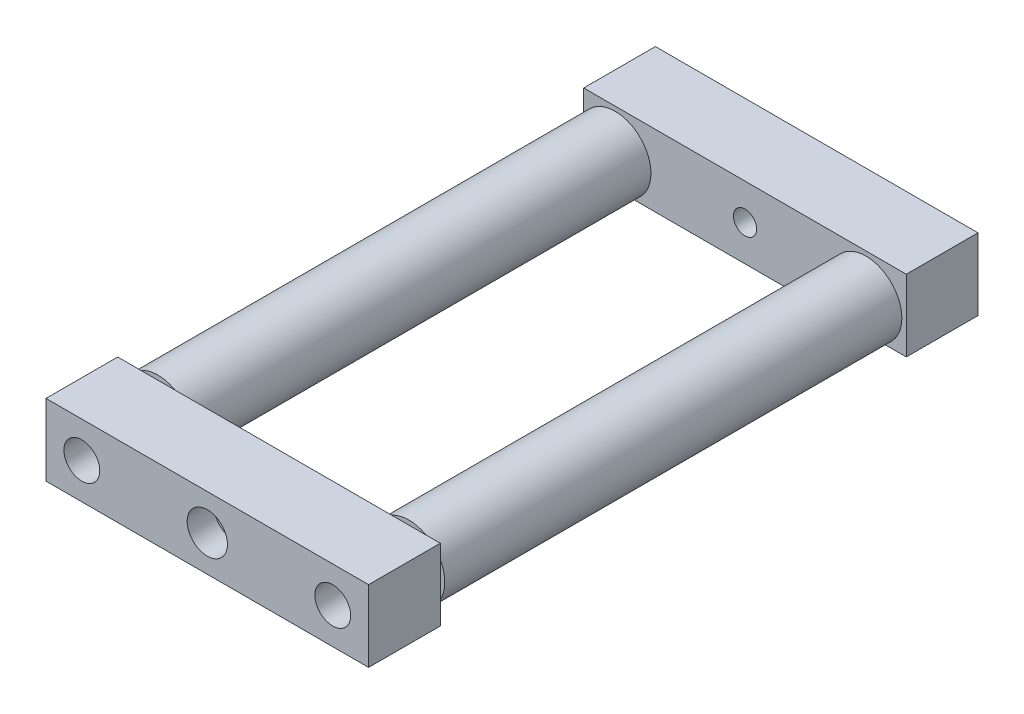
ISO-10303-21;
HEADER;
FILE_DESCRIPTION(('STEP AP214'),'2;1');
FILE_NAME('part.step','',(''),(''),'','','');
FILE_SCHEMA(('AUTOMOTIVE_DESIGN { 1 0 10303 214 1 1 1 1 }'));
ENDSEC;
DATA;
#1=APPLICATION_CONTEXT('core data for automotive mechanical design processes');
#2=APPLICATION_PROTOCOL_DEFINITION('international standard','automotive_design',2000,#1);
#3=PRODUCT_CONTEXT('',#1,'mechanical');
#4=PRODUCT('Part','Part','',(#3));
#5=PRODUCT_RELATED_PRODUCT_CATEGORY('part','',(#4));
#6=PRODUCT_DEFINITION_FORMATION('','',#4);
#7=PRODUCT_DEFINITION_CONTEXT('part definition',#1,'design');
#8=PRODUCT_DEFINITION('design','',#6,#7);
#9=PRODUCT_DEFINITION_SHAPE('','',#8);
#10=(LENGTH_UNIT() NAMED_UNIT(*) SI_UNIT(.MILLI.,.METRE.));
#11=(NAMED_UNIT(*) PLANE_ANGLE_UNIT() SI_UNIT($,.RADIAN.));
#12=(NAMED_UNIT(*) SI_UNIT($,.STERADIAN.) SOLID_ANGLE_UNIT());
#13=UNCERTAINTY_MEASURE_WITH_UNIT(LENGTH_MEASURE(1.E-05),#10,'distance_accuracy_value','');
#14=(GEOMETRIC_REPRESENTATION_CONTEXT(3) GLOBAL_UNCERTAINTY_ASSIGNED_CONTEXT((#13)) GLOBAL_UNIT_ASSIGNED_CONTEXT((#10,
#11,#12)) REPRESENTATION_CONTEXT('',''));
#15=CARTESIAN_POINT('',(0.,0.,0.));
#16=DIRECTION('',(0.,0.,1.));
#17=DIRECTION('',(1.,0.,0.));
#18=AXIS2_PLACEMENT_3D('',#15,#16,#17);
#19=CARTESIAN_POINT('',(22.225,0.,40.4876));
#20=DIRECTION('',(0.,0.,1.));
#21=DIRECTION('',(1.,0.,0.));
#22=AXIS2_PLACEMENT_3D('',#19,#20,#21);
#23=PLANE('',#22);
#24=CARTESIAN_POINT('',(22.225,0.,40.4876));
#25=DIRECTION('',(0.,0.,1.));
#26=DIRECTION('',(1.,0.,0.));
#27=AXIS2_PLACEMENT_3D('',#24,#25,#26);
#28=CIRCLE('',#27,6.35);
#29=CARTESIAN_POINT('',(28.575,0.,40.4876));
#30=VERTEX_POINT('',#29);
#31=EDGE_CURVE('E11',#30,#30,#28,.T.);
#32=ORIENTED_EDGE('',*,*,#31,.T.);
#33=EDGE_LOOP('',(#32));
#34=FACE_BOUND('',#33,.T.);
#35=CARTESIAN_POINT('',(22.225,0.,40.4876));
#36=DIRECTION('',(0.,0.,1.));
#37=DIRECTION('',(1.,0.,0.));
#38=AXIS2_PLACEMENT_3D('',#35,#36,#37);
#39=CIRCLE('',#38,3.175);
#40=CARTESIAN_POINT('',(25.4,0.,40.4876));
#41=VERTEX_POINT('',#40);
#42=EDGE_CURVE('E53',#41,#41,#39,.T.);
#43=ORIENTED_EDGE('',*,*,#42,.F.);
#44=EDGE_LOOP('',(#43));
#45=FACE_BOUND('',#44,.T.);
#46=ADVANCED_FACE('F42',(#34,#45),#23,.T.);
#47=CARTESIAN_POINT('',(22.225,0.,-40.4876));
#48=DIRECTION('',(0.,0.,1.));
#49=DIRECTION('',(1.,0.,0.));
#50=AXIS2_PLACEMENT_3D('',#47,#48,#49);
#51=PLANE('',#50);
#52=CARTESIAN_POINT('',(22.225,0.,-40.4876));
#53=DIRECTION('',(0.,0.,1.));
#54=DIRECTION('',(1.,0.,0.));
#55=AXIS2_PLACEMENT_3D('',#52,#53,#54);
#56=CIRCLE('',#55,6.35);
#57=CARTESIAN_POINT('',(28.575,0.,-40.4876));
#58=VERTEX_POINT('',#57);
#59=EDGE_CURVE('E46',#58,#58,#56,.T.);
#60=ORIENTED_EDGE('',*,*,#59,.F.);
#61=EDGE_LOOP('',(#60));
#62=FACE_BOUND('',#61,.T.);
#63=CARTESIAN_POINT('',(22.225,0.,-40.4876));
#64=DIRECTION('',(0.,0.,1.));
#65=DIRECTION('',(1.,0.,0.));
#66=AXIS2_PLACEMENT_3D('',#63,#64,#65);
#67=CIRCLE('',#66,3.175);
#68=CARTESIAN_POINT('',(25.4,0.,-40.4876));
#69=VERTEX_POINT('',#68);
#70=EDGE_CURVE('E55',#69,#69,#67,.T.);
#71=ORIENTED_EDGE('',*,*,#70,.T.);
#72=EDGE_LOOP('',(#71));
#73=FACE_BOUND('',#72,.T.);
#74=ADVANCED_FACE('F65',(#62,#73),#51,.F.);
#75=CARTESIAN_POINT('',(22.225,0.,40.4876));
#76=DIRECTION('',(0.,0.,-1.));
#77=DIRECTION('',(-1.,0.,0.));
#78=AXIS2_PLACEMENT_3D('',#75,#76,#77);
#79=CYLINDRICAL_SURFACE('',#78,6.35);
#80=ORIENTED_EDGE('',*,*,#31,.F.);
#81=EDGE_LOOP('',(#80));
#82=FACE_BOUND('',#81,.T.);
#83=ORIENTED_EDGE('',*,*,#59,.T.);
#84=EDGE_LOOP('',(#83));
#85=FACE_BOUND('',#84,.T.);
#86=ADVANCED_FACE('F44',(#82,#85),#79,.T.);
#87=CARTESIAN_POINT('',(22.225,0.,40.4876));
#88=DIRECTION('',(0.,0.,-1.));
#89=DIRECTION('',(-1.,0.,0.));
#90=AXIS2_PLACEMENT_3D('',#87,#88,#89);
#91=CYLINDRICAL_SURFACE('',#90,3.175);
#92=ORIENTED_EDGE('',*,*,#42,.T.);
#93=EDGE_LOOP('',(#92));
#94=FACE_BOUND('',#93,.T.);
#95=ORIENTED_EDGE('',*,*,#70,.F.);
#96=EDGE_LOOP('',(#95));
#97=FACE_BOUND('',#96,.T.);
#98=ADVANCED_FACE('F61',(#94,#97),#91,.F.);
#99=CLOSED_SHELL('',(#46,#74,#86,#98));
#100=MANIFOLD_SOLID_BREP('B2',#99);
#101=CARTESIAN_POINT('',(-22.225,0.,40.4876));
#102=DIRECTION('',(0.,0.,1.));
#103=DIRECTION('',(1.,0.,0.));
#104=AXIS2_PLACEMENT_3D('',#101,#102,#103);
#105=PLANE('',#104);
#106=CARTESIAN_POINT('',(-22.225,0.,40.4876));
#107=DIRECTION('',(0.,0.,1.));
#108=DIRECTION('',(1.,0.,0.));
#109=AXIS2_PLACEMENT_3D('',#106,#107,#108);
#110=CIRCLE('',#109,6.35);
#111=CARTESIAN_POINT('',(-15.875,0.,40.4876));
#112=VERTEX_POINT('',#111);
#113=EDGE_CURVE('E41',#112,#112,#110,.T.);
#114=ORIENTED_EDGE('',*,*,#113,.T.);
#115=EDGE_LOOP('',(#114));
#116=FACE_BOUND('',#115,.T.);
#117=CARTESIAN_POINT('',(-22.225,0.,40.4876));
#118=DIRECTION('',(0.,0.,1.));
#119=DIRECTION('',(1.,0.,0.));
#120=AXIS2_PLACEMENT_3D('',#117,#118,#119);
#121=CIRCLE('',#120,3.175);
#122=CARTESIAN_POINT('',(-19.05,0.,40.4876));
#123=VERTEX_POINT('',#122);
#124=EDGE_CURVE('E125',#123,#123,#121,.T.);
#125=ORIENTED_EDGE('',*,*,#124,.F.);
#126=EDGE_LOOP('',(#125));
#127=FACE_BOUND('',#126,.T.);
#128=ADVANCED_FACE('F114',(#116,#127),#105,.T.);
#129=CARTESIAN_POINT('',(-22.225,0.,-40.4876));
#130=DIRECTION('',(0.,0.,1.));
#131=DIRECTION('',(1.,0.,0.));
#132=AXIS2_PLACEMENT_3D('',#129,#130,#131);
#133=PLANE('',#132);
#134=CARTESIAN_POINT('',(-22.225,0.,-40.4876));
#135=DIRECTION('',(0.,0.,1.));
#136=DIRECTION('',(1.,0.,0.));
#137=AXIS2_PLACEMENT_3D('',#134,#135,#136);
#138=CIRCLE('',#137,6.35);
#139=CARTESIAN_POINT('',(-15.875,0.,-40.4876));
#140=VERTEX_POINT('',#139);
#141=EDGE_CURVE('E118',#140,#140,#138,.T.);
#142=ORIENTED_EDGE('',*,*,#141,.F.);
#143=EDGE_LOOP('',(#142));
#144=FACE_BOUND('',#143,.T.);
#145=CARTESIAN_POINT('',(-22.225,0.,-40.4876));
#146=DIRECTION('',(0.,0.,1.));
#147=DIRECTION('',(1.,0.,0.));
#148=AXIS2_PLACEMENT_3D('',#145,#146,#147);
#149=CIRCLE('',#148,3.175);
#150=CARTESIAN_POINT('',(-19.05,0.,-40.4876));
#151=VERTEX_POINT('',#150);
#152=EDGE_CURVE('E127',#151,#151,#149,.T.);
#153=ORIENTED_EDGE('',*,*,#152,.T.);
#154=EDGE_LOOP('',(#153));
#155=FACE_BOUND('',#154,.T.);
#156=ADVANCED_FACE('F137',(#144,#155),#133,.F.);
#157=CARTESIAN_POINT('',(-22.225,0.,40.4876));
#158=DIRECTION('',(0.,0.,-1.));
#159=DIRECTION('',(-1.,0.,0.));
#160=AXIS2_PLACEMENT_3D('',#157,#158,#159);
#161=CYLINDRICAL_SURFACE('',#160,6.35);
#162=ORIENTED_EDGE('',*,*,#113,.F.);
#163=EDGE_LOOP('',(#162));
#164=FACE_BOUND('',#163,.T.);
#165=ORIENTED_EDGE('',*,*,#141,.T.);
#166=EDGE_LOOP('',(#165));
#167=FACE_BOUND('',#166,.T.);
#168=ADVANCED_FACE('F116',(#164,#167),#161,.T.);
#169=CARTESIAN_POINT('',(-22.225,0.,40.4876));
#170=DIRECTION('',(0.,0.,-1.));
#171=DIRECTION('',(-1.,0.,0.));
#172=AXIS2_PLACEMENT_3D('',#169,#170,#171);
#173=CYLINDRICAL_SURFACE('',#172,3.175);
#174=ORIENTED_EDGE('',*,*,#124,.T.);
#175=EDGE_LOOP('',(#174));
#176=FACE_BOUND('',#175,.T.);
#177=ORIENTED_EDGE('',*,*,#152,.F.);
#178=EDGE_LOOP('',(#177));
#179=FACE_BOUND('',#178,.T.);
#180=ADVANCED_FACE('F133',(#176,#179),#173,.F.);
#181=CLOSED_SHELL('',(#128,#156,#168,#180));
#182=MANIFOLD_SOLID_BREP('B6',#181);
#183=CARTESIAN_POINT('',(-28.575,6.35,-53.975));
#184=DIRECTION('',(-1.,0.,0.));
#185=DIRECTION('',(0.,0.,1.));
#186=AXIS2_PLACEMENT_3D('',#183,#184,#185);
#187=PLANE('',#186);
#188=DIRECTION('',(0.,-1.,0.));
#189=VECTOR('',#188,1.);
#190=CARTESIAN_POINT('',(-28.575,6.35,-41.275));
#191=LINE('',#190,#189);
#192=CARTESIAN_POINT('',(-28.575,6.35,-41.275));
#193=VERTEX_POINT('',#192);
#194=CARTESIAN_POINT('',(-28.575,-6.35,-41.275));
#195=VERTEX_POINT('',#194);
#196=EDGE_CURVE('E252',#193,#195,#191,.T.);
#197=ORIENTED_EDGE('',*,*,#196,.F.);
#198=DIRECTION('',(0.,0.,1.));
#199=VECTOR('',#198,1.);
#200=CARTESIAN_POINT('',(-28.575,6.35,-53.975));
#201=LINE('',#200,#199);
#202=CARTESIAN_POINT('',(-28.575,6.35,-53.975));
#203=VERTEX_POINT('',#202);
#204=EDGE_CURVE('E112',#203,#193,#201,.T.);
#205=ORIENTED_EDGE('',*,*,#204,.F.);
#206=DIRECTION('',(0.,-1.,0.));
#207=VECTOR('',#206,1.);
#208=CARTESIAN_POINT('',(-28.575,6.35,-53.975));
#209=LINE('',#208,#207);
#210=CARTESIAN_POINT('',(-28.575,-6.35,-53.975));
#211=VERTEX_POINT('',#210);
#212=EDGE_CURVE('E245',#203,#211,#209,.T.);
#213=ORIENTED_EDGE('',*,*,#212,.T.);
#214=DIRECTION('',(0.,0.,1.));
#215=VECTOR('',#214,1.);
#216=CARTESIAN_POINT('',(-28.575,-6.35,-53.975));
#217=LINE('',#216,#215);
#218=EDGE_CURVE('E228',#211,#195,#217,.T.);
#219=ORIENTED_EDGE('',*,*,#218,.T.);
#220=EDGE_LOOP('',(#197,#205,#213,#219));
#221=FACE_BOUND('',#220,.T.);
#222=ADVANCED_FACE('F185',(#221),#187,.T.);
#223=CARTESIAN_POINT('',(28.575,6.35000000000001,-53.975));
#224=DIRECTION('',(0.,1.,0.));
#225=DIRECTION('',(-1.,0.,0.));
#226=AXIS2_PLACEMENT_3D('',#223,#224,#225);
#227=PLANE('',#226);
#228=DIRECTION('',(-1.,0.,0.));
#229=VECTOR('',#228,1.);
#230=CARTESIAN_POINT('',(28.575,6.35000000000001,-41.275));
#231=LINE('',#230,#229);
#232=CARTESIAN_POINT('',(28.575,6.35000000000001,-41.275));
#233=VERTEX_POINT('',#232);
#234=EDGE_CURVE('E247',#233,#193,#231,.T.);
#235=ORIENTED_EDGE('',*,*,#234,.F.);
#236=DIRECTION('',(0.,0.,1.));
#237=VECTOR('',#236,1.);
#238=CARTESIAN_POINT('',(28.575,6.35000000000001,-53.975));
#239=LINE('',#238,#237);
#240=CARTESIAN_POINT('',(28.575,6.35000000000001,-53.975));
#241=VERTEX_POINT('',#240);
#242=EDGE_CURVE('E194',#241,#233,#239,.T.);
#243=ORIENTED_EDGE('',*,*,#242,.F.);
#244=DIRECTION('',(-1.,0.,0.));
#245=VECTOR('',#244,1.);
#246=CARTESIAN_POINT('',(28.575,6.35000000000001,-53.975));
#247=LINE('',#246,#245);
#248=EDGE_CURVE('E242',#241,#203,#247,.T.);
#249=ORIENTED_EDGE('',*,*,#248,.T.);
#250=ORIENTED_EDGE('',*,*,#204,.T.);
#251=EDGE_LOOP('',(#235,#243,#249,#250));
#252=FACE_BOUND('',#251,.T.);
#253=ADVANCED_FACE('F294',(#252),#227,.T.);
#254=CARTESIAN_POINT('',(28.575,-6.35,-53.975));
#255=DIRECTION('',(1.,0.,0.));
#256=DIRECTION('',(0.,0.,-1.));
#257=AXIS2_PLACEMENT_3D('',#254,#255,#256);
#258=PLANE('',#257);
#259=DIRECTION('',(0.,1.,0.));
#260=VECTOR('',#259,1.);
#261=CARTESIAN_POINT('',(28.575,-6.35,-41.275));
#262=LINE('',#261,#260);
#263=CARTESIAN_POINT('',(28.575,-6.35,-41.275));
#264=VERTEX_POINT('',#263);
#265=EDGE_CURVE('E236',#264,#233,#262,.T.);
#266=ORIENTED_EDGE('',*,*,#265,.F.);
#267=DIRECTION('',(0.,0.,1.));
#268=VECTOR('',#267,1.);
#269=CARTESIAN_POINT('',(28.575,-6.35,-53.975));
#270=LINE('',#269,#268);
#271=CARTESIAN_POINT('',(28.575,-6.35,-53.975));
#272=VERTEX_POINT('',#271);
#273=EDGE_CURVE('E231',#272,#264,#270,.T.);
#274=ORIENTED_EDGE('',*,*,#273,.F.);
#275=DIRECTION('',(0.,1.,0.));
#276=VECTOR('',#275,1.);
#277=CARTESIAN_POINT('',(28.575,-6.35,-53.975));
#278=LINE('',#277,#276);
#279=EDGE_CURVE('E234',#272,#241,#278,.T.);
#280=ORIENTED_EDGE('',*,*,#279,.T.);
#281=ORIENTED_EDGE('',*,*,#242,.T.);
#282=EDGE_LOOP('',(#266,#274,#280,#281));
#283=FACE_BOUND('',#282,.T.);
#284=ADVANCED_FACE('F233',(#283),#258,.T.);
#285=CARTESIAN_POINT('',(-28.575,-6.35,-53.975));
#286=DIRECTION('',(0.,-1.,0.));
#287=DIRECTION('',(0.,0.,-1.));
#288=AXIS2_PLACEMENT_3D('',#285,#286,#287);
#289=PLANE('',#288);
#290=DIRECTION('',(1.,0.,0.));
#291=VECTOR('',#290,1.);
#292=CARTESIAN_POINT('',(-28.575,-6.35,-41.275));
#293=LINE('',#292,#291);
#294=EDGE_CURVE('E255',#195,#264,#293,.T.);
#295=ORIENTED_EDGE('',*,*,#294,.F.);
#296=ORIENTED_EDGE('',*,*,#218,.F.);
#297=DIRECTION('',(1.,0.,0.));
#298=VECTOR('',#297,1.);
#299=CARTESIAN_POINT('',(-28.575,-6.35,-53.975));
#300=LINE('',#299,#298);
#301=EDGE_CURVE('E241',#211,#272,#300,.T.);
#302=ORIENTED_EDGE('',*,*,#301,.T.);
#303=ORIENTED_EDGE('',*,*,#273,.T.);
#304=EDGE_LOOP('',(#295,#296,#302,#303));
#305=FACE_BOUND('',#304,.T.);
#306=ADVANCED_FACE('F244',(#305),#289,.T.);
#307=CARTESIAN_POINT('',(0.,0.,-53.975));
#308=DIRECTION('',(0.,0.,1.));
#309=DIRECTION('',(1.,0.,0.));
#310=AXIS2_PLACEMENT_3D('',#307,#308,#309);
#311=PLANE('',#310);
#312=CARTESIAN_POINT('',(0.,0.,-53.975));
#313=DIRECTION('',(0.,0.,1.));
#314=DIRECTION('',(1.,0.,0.));
#315=AXIS2_PLACEMENT_3D('',#312,#313,#314);
#316=CIRCLE('',#315,3.5687);
#317=CARTESIAN_POINT('',(3.5687,0.,-53.975));
#318=VERTEX_POINT('',#317);
#319=EDGE_CURVE('E188',#318,#318,#316,.T.);
#320=ORIENTED_EDGE('',*,*,#319,.T.);
#321=EDGE_LOOP('',(#320));
#322=FACE_BOUND('',#321,.T.);
#323=CARTESIAN_POINT('',(22.225,0.,-53.975));
#324=DIRECTION('',(0.,0.,1.));
#325=DIRECTION('',(1.,0.,0.));
#326=AXIS2_PLACEMENT_3D('',#323,#324,#325);
#327=CIRCLE('',#326,3.175);
#328=CARTESIAN_POINT('',(25.4,0.,-53.975));
#329=VERTEX_POINT('',#328);
#330=EDGE_CURVE('E277',#329,#329,#327,.T.);
#331=ORIENTED_EDGE('',*,*,#330,.T.);
#332=EDGE_LOOP('',(#331));
#333=FACE_BOUND('',#332,.T.);
#334=CARTESIAN_POINT('',(-22.225,0.,-53.975));
#335=DIRECTION('',(0.,0.,1.));
#336=DIRECTION('',(1.,0.,0.));
#337=AXIS2_PLACEMENT_3D('',#334,#335,#336);
#338=CIRCLE('',#337,3.175);
#339=CARTESIAN_POINT('',(-19.05,0.,-53.975));
#340=VERTEX_POINT('',#339);
#341=EDGE_CURVE('E256',#340,#340,#338,.T.);
#342=ORIENTED_EDGE('',*,*,#341,.T.);
#343=EDGE_LOOP('',(#342));
#344=FACE_BOUND('',#343,.T.);
#345=ORIENTED_EDGE('',*,*,#212,.F.);
#346=ORIENTED_EDGE('',*,*,#248,.F.);
#347=ORIENTED_EDGE('',*,*,#279,.F.);
#348=ORIENTED_EDGE('',*,*,#301,.F.);
#349=EDGE_LOOP('',(#345,#346,#347,#348));
#350=FACE_BOUND('',#349,.T.);
#351=ADVANCED_FACE('F240',(#322,#333,#344,#350),#311,.F.);
#352=CARTESIAN_POINT('',(0.,0.,-41.275));
#353=DIRECTION('',(0.,0.,1.));
#354=DIRECTION('',(1.,0.,0.));
#355=AXIS2_PLACEMENT_3D('',#352,#353,#354);
#356=PLANE('',#355);
#357=CARTESIAN_POINT('',(0.,0.,-41.275));
#358=DIRECTION('',(0.,0.,1.));
#359=DIRECTION('',(1.,0.,0.));
#360=AXIS2_PLACEMENT_3D('',#357,#358,#359);
#361=CIRCLE('',#360,2.0574);
#362=CARTESIAN_POINT('',(2.0574,0.,-41.275));
#363=VERTEX_POINT('',#362);
#364=EDGE_CURVE('E263',#363,#363,#361,.T.);
#365=ORIENTED_EDGE('',*,*,#364,.F.);
#366=EDGE_LOOP('',(#365));
#367=FACE_BOUND('',#366,.T.);
#368=CARTESIAN_POINT('',(22.225,0.,-41.275));
#369=DIRECTION('',(0.,0.,1.));
#370=DIRECTION('',(1.,0.,0.));
#371=AXIS2_PLACEMENT_3D('',#368,#369,#370);
#372=CIRCLE('',#371,3.175);
#373=CARTESIAN_POINT('',(25.4,0.,-41.275));
#374=VERTEX_POINT('',#373);
#375=EDGE_CURVE('E265',#374,#374,#372,.T.);
#376=ORIENTED_EDGE('',*,*,#375,.F.);
#377=EDGE_LOOP('',(#376));
#378=FACE_BOUND('',#377,.T.);
#379=CARTESIAN_POINT('',(-22.225,0.,-41.275));
#380=DIRECTION('',(0.,0.,1.));
#381=DIRECTION('',(1.,0.,0.));
#382=AXIS2_PLACEMENT_3D('',#379,#380,#381);
#383=CIRCLE('',#382,3.175);
#384=CARTESIAN_POINT('',(-19.05,0.,-41.275));
#385=VERTEX_POINT('',#384);
#386=EDGE_CURVE('E280',#385,#385,#383,.T.);
#387=ORIENTED_EDGE('',*,*,#386,.F.);
#388=EDGE_LOOP('',(#387));
#389=FACE_BOUND('',#388,.T.);
#390=ORIENTED_EDGE('',*,*,#196,.T.);
#391=ORIENTED_EDGE('',*,*,#294,.T.);
#392=ORIENTED_EDGE('',*,*,#265,.T.);
#393=ORIENTED_EDGE('',*,*,#234,.T.);
#394=EDGE_LOOP('',(#390,#391,#392,#393));
#395=FACE_BOUND('',#394,.T.);
#396=ADVANCED_FACE('F289',(#367,#378,#389,#395),#356,.T.);
#397=CARTESIAN_POINT('',(-22.225,0.,-53.975));
#398=DIRECTION('',(0.,0.,1.));
#399=DIRECTION('',(1.,0.,0.));
#400=AXIS2_PLACEMENT_3D('',#397,#398,#399);
#401=CYLINDRICAL_SURFACE('',#400,3.175);
#402=ORIENTED_EDGE('',*,*,#341,.F.);
#403=EDGE_LOOP('',(#402));
#404=FACE_BOUND('',#403,.T.);
#405=ORIENTED_EDGE('',*,*,#386,.T.);
#406=EDGE_LOOP('',(#405));
#407=FACE_BOUND('',#406,.T.);
#408=ADVANCED_FACE('F287',(#404,#407),#401,.F.);
#409=CARTESIAN_POINT('',(22.225,0.,-53.975));
#410=DIRECTION('',(0.,0.,1.));
#411=DIRECTION('',(1.,0.,0.));
#412=AXIS2_PLACEMENT_3D('',#409,#410,#411);
#413=CYLINDRICAL_SURFACE('',#412,3.175);
#414=ORIENTED_EDGE('',*,*,#330,.F.);
#415=EDGE_LOOP('',(#414));
#416=FACE_BOUND('',#415,.T.);
#417=ORIENTED_EDGE('',*,*,#375,.T.);
#418=EDGE_LOOP('',(#417));
#419=FACE_BOUND('',#418,.T.);
#420=ADVANCED_FACE('F314',(#416,#419),#413,.F.);
#421=CARTESIAN_POINT('',(0.,0.,-50.8));
#422=DIRECTION('',(0.,0.,1.));
#423=DIRECTION('',(1.,0.,0.));
#424=AXIS2_PLACEMENT_3D('',#421,#422,#423);
#425=CYLINDRICAL_SURFACE('',#424,2.0574);
#426=CARTESIAN_POINT('',(0.,0.,-49.2252));
#427=DIRECTION('',(0.,0.,1.));
#428=DIRECTION('',(1.,0.,0.));
#429=AXIS2_PLACEMENT_3D('',#426,#427,#428);
#430=CIRCLE('',#429,2.0574);
#431=CARTESIAN_POINT('',(2.0574,0.,-49.2252));
#432=VERTEX_POINT('',#431);
#433=EDGE_CURVE('E266',#432,#432,#430,.F.);
#434=ORIENTED_EDGE('',*,*,#433,.T.);
#435=EDGE_LOOP('',(#434));
#436=FACE_BOUND('',#435,.T.);
#437=ORIENTED_EDGE('',*,*,#364,.T.);
#438=EDGE_LOOP('',(#437));
#439=FACE_BOUND('',#438,.T.);
#440=ADVANCED_FACE('F318',(#436,#439),#425,.F.);
#441=CARTESIAN_POINT('',(0.,0.,-74.6252));
#442=DIRECTION('',(0.,0.,1.));
#443=DIRECTION('',(1.,0.,0.));
#444=AXIS2_PLACEMENT_3D('',#441,#442,#443);
#445=CYLINDRICAL_SURFACE('',#444,3.5687);
#446=CARTESIAN_POINT('',(0.,0.,-49.2252));
#447=DIRECTION('',(0.,0.,1.));
#448=DIRECTION('',(1.,0.,0.));
#449=AXIS2_PLACEMENT_3D('',#446,#447,#448);
#450=CIRCLE('',#449,3.5687);
#451=CARTESIAN_POINT('',(3.5687,0.,-49.2252));
#452=VERTEX_POINT('',#451);
#453=EDGE_CURVE('E268',#452,#452,#450,.T.);
#454=ORIENTED_EDGE('',*,*,#453,.T.);
#455=EDGE_LOOP('',(#454));
#456=FACE_BOUND('',#455,.T.);
#457=ORIENTED_EDGE('',*,*,#319,.F.);
#458=EDGE_LOOP('',(#457));
#459=FACE_BOUND('',#458,.T.);
#460=ADVANCED_FACE('F322',(#456,#459),#445,.F.);
#461=CARTESIAN_POINT('',(0.,0.,-49.2252));
#462=DIRECTION('',(0.,0.,1.));
#463=DIRECTION('',(1.,0.,0.));
#464=AXIS2_PLACEMENT_3D('',#461,#462,#463);
#465=PLANE('',#464);
#466=ORIENTED_EDGE('',*,*,#453,.F.);
#467=EDGE_LOOP('',(#466));
#468=FACE_BOUND('',#467,.T.);
#469=ORIENTED_EDGE('',*,*,#433,.F.);
#470=EDGE_LOOP('',(#469));
#471=FACE_BOUND('',#470,.T.);
#472=ADVANCED_FACE('F325',(#468,#471),#465,.F.);
#473=CLOSED_SHELL('',(#222,#253,#284,#306,#351,#396,#408,#420,#440,#460,#472));
#474=MANIFOLD_SOLID_BREP('B36',#473);
#475=CARTESIAN_POINT('',(0.,0.,53.975));
#476=DIRECTION('',(0.,0.,1.));
#477=DIRECTION('',(1.,0.,0.));
#478=AXIS2_PLACEMENT_3D('',#475,#476,#477);
#479=PLANE('',#478);
#480=CARTESIAN_POINT('',(22.225,0.,53.975));
#481=DIRECTION('',(0.,0.,1.));
#482=DIRECTION('',(1.,0.,0.));
#483=AXIS2_PLACEMENT_3D('',#480,#481,#482);
#484=CIRCLE('',#483,3.175);
#485=CARTESIAN_POINT('',(25.4,0.,53.975));
#486=VERTEX_POINT('',#485);
#487=EDGE_CURVE('E492',#486,#486,#484,.T.);
#488=ORIENTED_EDGE('',*,*,#487,.F.);
#489=EDGE_LOOP('',(#488));
#490=FACE_BOUND('',#489,.T.);
#491=DIRECTION('',(0.,-1.,0.));
#492=VECTOR('',#491,1.);
#493=CARTESIAN_POINT('',(-28.575,6.35,53.975));
#494=LINE('',#493,#492);
#495=CARTESIAN_POINT('',(-28.575,6.35,53.975));
#496=VERTEX_POINT('',#495);
#497=CARTESIAN_POINT('',(-28.575,-6.35,53.975));
#498=VERTEX_POINT('',#497);
#499=EDGE_CURVE('E456',#496,#498,#494,.T.);
#500=ORIENTED_EDGE('',*,*,#499,.T.);
#501=DIRECTION('',(1.,0.,0.));
#502=VECTOR('',#501,1.);
#503=CARTESIAN_POINT('',(-28.575,-6.35,53.975));
#504=LINE('',#503,#502);
#505=CARTESIAN_POINT('',(28.575,-6.35,53.975));
#506=VERTEX_POINT('',#505);
#507=EDGE_CURVE('E451',#498,#506,#504,.T.);
#508=ORIENTED_EDGE('',*,*,#507,.T.);
#509=DIRECTION('',(0.,1.,0.));
#510=VECTOR('',#509,1.);
#511=CARTESIAN_POINT('',(28.575,-6.35,53.975));
#512=LINE('',#511,#510);
#513=CARTESIAN_POINT('',(28.575,6.35000000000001,53.975));
#514=VERTEX_POINT('',#513);
#515=EDGE_CURVE('E454',#506,#514,#512,.T.);
#516=ORIENTED_EDGE('',*,*,#515,.T.);
#517=DIRECTION('',(-1.,0.,0.));
#518=VECTOR('',#517,1.);
#519=CARTESIAN_POINT('',(28.575,6.35000000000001,53.975));
#520=LINE('',#519,#518);
#521=EDGE_CURVE('E421',#514,#496,#520,.T.);
#522=ORIENTED_EDGE('',*,*,#521,.T.);
#523=EDGE_LOOP('',(#500,#508,#516,#522));
#524=FACE_BOUND('',#523,.T.);
#525=CARTESIAN_POINT('',(-22.225,0.,53.975));
#526=DIRECTION('',(0.,0.,1.));
#527=DIRECTION('',(1.,0.,0.));
#528=AXIS2_PLACEMENT_3D('',#525,#526,#527);
#529=CIRCLE('',#528,3.175);
#530=CARTESIAN_POINT('',(-19.05,0.,53.975));
#531=VERTEX_POINT('',#530);
#532=EDGE_CURVE('E472',#531,#531,#529,.T.);
#533=ORIENTED_EDGE('',*,*,#532,.F.);
#534=EDGE_LOOP('',(#533));
#535=FACE_BOUND('',#534,.T.);
#536=CARTESIAN_POINT('',(0.,0.,53.975));
#537=DIRECTION('',(0.,0.,1.));
#538=DIRECTION('',(1.,0.,0.));
#539=AXIS2_PLACEMENT_3D('',#536,#537,#538);
#540=CIRCLE('',#539,3.5687);
#541=CARTESIAN_POINT('',(3.5687,0.,53.975));
#542=VERTEX_POINT('',#541);
#543=EDGE_CURVE('E406',#542,#542,#540,.F.);
#544=ORIENTED_EDGE('',*,*,#543,.T.);
#545=EDGE_LOOP('',(#544));
#546=FACE_BOUND('',#545,.T.);
#547=ADVANCED_FACE('F402',(#490,#524,#535,#546),#479,.T.);
#548=CARTESIAN_POINT('',(0.,0.,-50.8));
#549=DIRECTION('',(0.,0.,1.));
#550=DIRECTION('',(1.,0.,0.));
#551=AXIS2_PLACEMENT_3D('',#548,#549,#550);
#552=CYLINDRICAL_SURFACE('',#551,2.0574);
#553=CARTESIAN_POINT('',(0.,0.,41.275));
#554=DIRECTION('',(0.,0.,1.));
#555=DIRECTION('',(1.,0.,0.));
#556=AXIS2_PLACEMENT_3D('',#553,#554,#555);
#557=CIRCLE('',#556,2.0574);
#558=CARTESIAN_POINT('',(2.0574,0.,41.275));
#559=VERTEX_POINT('',#558);
#560=EDGE_CURVE('E478',#559,#559,#557,.T.);
#561=ORIENTED_EDGE('',*,*,#560,.F.);
#562=EDGE_LOOP('',(#561));
#563=FACE_BOUND('',#562,.T.);
#564=CARTESIAN_POINT('',(0.,0.,49.2252));
#565=DIRECTION('',(0.,0.,1.));
#566=DIRECTION('',(1.,0.,0.));
#567=AXIS2_PLACEMENT_3D('',#564,#565,#566);
#568=CIRCLE('',#567,2.0574);
#569=CARTESIAN_POINT('',(2.0574,0.,49.2252));
#570=VERTEX_POINT('',#569);
#571=EDGE_CURVE('E481',#570,#570,#568,.F.);
#572=ORIENTED_EDGE('',*,*,#571,.F.);
#573=EDGE_LOOP('',(#572));
#574=FACE_BOUND('',#573,.T.);
#575=ADVANCED_FACE('F522',(#563,#574),#552,.F.);
#576=CARTESIAN_POINT('',(0.,0.,41.275));
#577=DIRECTION('',(0.,0.,1.));
#578=DIRECTION('',(1.,0.,0.));
#579=AXIS2_PLACEMENT_3D('',#576,#577,#578);
#580=PLANE('',#579);
#581=ORIENTED_EDGE('',*,*,#560,.T.);
#582=EDGE_LOOP('',(#581));
#583=FACE_BOUND('',#582,.T.);
#584=CARTESIAN_POINT('',(-22.225,0.,41.275));
#585=DIRECTION('',(0.,0.,1.));
#586=DIRECTION('',(1.,0.,0.));
#587=AXIS2_PLACEMENT_3D('',#584,#585,#586);
#588=CIRCLE('',#587,3.175);
#589=CARTESIAN_POINT('',(-19.05,0.,41.275));
#590=VERTEX_POINT('',#589);
#591=EDGE_CURVE('E495',#590,#590,#588,.T.);
#592=ORIENTED_EDGE('',*,*,#591,.T.);
#593=EDGE_LOOP('',(#592));
#594=FACE_BOUND('',#593,.T.);
#595=DIRECTION('',(0.,-1.,0.));
#596=VECTOR('',#595,1.);
#597=CARTESIAN_POINT('',(-28.575,6.35,41.275));
#598=LINE('',#597,#596);
#599=CARTESIAN_POINT('',(-28.575,6.35,41.275));
#600=VERTEX_POINT('',#599);
#601=CARTESIAN_POINT('',(-28.575,-6.35,41.275));
#602=VERTEX_POINT('',#601);
#603=EDGE_CURVE('E469',#600,#602,#598,.T.);
#604=ORIENTED_EDGE('',*,*,#603,.F.);
#605=DIRECTION('',(-1.,0.,0.));
#606=VECTOR('',#605,1.);
#607=CARTESIAN_POINT('',(28.575,6.35000000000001,41.275));
#608=LINE('',#607,#606);
#609=CARTESIAN_POINT('',(28.575,6.35000000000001,41.275));
#610=VERTEX_POINT('',#609);
#611=EDGE_CURVE('E444',#610,#600,#608,.T.);
#612=ORIENTED_EDGE('',*,*,#611,.F.);
#613=DIRECTION('',(0.,1.,0.));
#614=VECTOR('',#613,1.);
#615=CARTESIAN_POINT('',(28.575,-6.35,41.275));
#616=LINE('',#615,#614);
#617=CARTESIAN_POINT('',(28.575,-6.35,41.275));
#618=VERTEX_POINT('',#617);
#619=EDGE_CURVE('E438',#618,#610,#616,.T.);
#620=ORIENTED_EDGE('',*,*,#619,.F.);
#621=DIRECTION('',(1.,0.,0.));
#622=VECTOR('',#621,1.);
#623=CARTESIAN_POINT('',(-28.575,-6.35,41.275));
#624=LINE('',#623,#622);
#625=EDGE_CURVE('E460',#602,#618,#624,.T.);
#626=ORIENTED_EDGE('',*,*,#625,.F.);
#627=EDGE_LOOP('',(#604,#612,#620,#626));
#628=FACE_BOUND('',#627,.T.);
#629=CARTESIAN_POINT('',(22.225,0.,41.275));
#630=DIRECTION('',(0.,0.,1.));
#631=DIRECTION('',(1.,0.,0.));
#632=AXIS2_PLACEMENT_3D('',#629,#630,#631);
#633=CIRCLE('',#632,3.175);
#634=CARTESIAN_POINT('',(25.4,0.,41.275));
#635=VERTEX_POINT('',#634);
#636=EDGE_CURVE('E480',#635,#635,#633,.T.);
#637=ORIENTED_EDGE('',*,*,#636,.T.);
#638=EDGE_LOOP('',(#637));
#639=FACE_BOUND('',#638,.T.);
#640=ADVANCED_FACE('F503',(#583,#594,#628,#639),#580,.F.);
#641=CARTESIAN_POINT('',(-28.575,6.35,53.975));
#642=DIRECTION('',(1.,0.,0.));
#643=DIRECTION('',(0.,0.,-1.));
#644=AXIS2_PLACEMENT_3D('',#641,#642,#643);
#645=PLANE('',#644);
#646=ORIENTED_EDGE('',*,*,#603,.T.);
#647=DIRECTION('',(0.,0.,-1.));
#648=VECTOR('',#647,1.);
#649=CARTESIAN_POINT('',(-28.575,-6.35,53.975));
#650=LINE('',#649,#648);
#651=EDGE_CURVE('E183',#498,#602,#650,.T.);
#652=ORIENTED_EDGE('',*,*,#651,.F.);
#653=ORIENTED_EDGE('',*,*,#499,.F.);
#654=DIRECTION('',(0.,0.,-1.));
#655=VECTOR('',#654,1.);
#656=CARTESIAN_POINT('',(-28.575,6.35,53.975));
#657=LINE('',#656,#655);
#658=EDGE_CURVE('E465',#496,#600,#657,.T.);
#659=ORIENTED_EDGE('',*,*,#658,.T.);
#660=EDGE_LOOP('',(#646,#652,#653,#659));
#661=FACE_BOUND('',#660,.T.);
#662=ADVANCED_FACE('F404',(#661),#645,.F.);
#663=CARTESIAN_POINT('',(-28.575,-6.35,53.975));
#664=DIRECTION('',(0.,1.,0.));
#665=DIRECTION('',(0.,0.,1.));
#666=AXIS2_PLACEMENT_3D('',#663,#664,#665);
#667=PLANE('',#666);
#668=ORIENTED_EDGE('',*,*,#625,.T.);
#669=DIRECTION('',(0.,0.,-1.));
#670=VECTOR('',#669,1.);
#671=CARTESIAN_POINT('',(28.575,-6.35,53.975));
#672=LINE('',#671,#670);
#673=EDGE_CURVE('E412',#506,#618,#672,.T.);
#674=ORIENTED_EDGE('',*,*,#673,.F.);
#675=ORIENTED_EDGE('',*,*,#507,.F.);
#676=ORIENTED_EDGE('',*,*,#651,.T.);
#677=EDGE_LOOP('',(#668,#674,#675,#676));
#678=FACE_BOUND('',#677,.T.);
#679=ADVANCED_FACE('F459',(#678),#667,.F.);
#680=CARTESIAN_POINT('',(28.575,-6.35,53.975));
#681=DIRECTION('',(-1.,0.,0.));
#682=DIRECTION('',(0.,0.,1.));
#683=AXIS2_PLACEMENT_3D('',#680,#681,#682);
#684=PLANE('',#683);
#685=ORIENTED_EDGE('',*,*,#619,.T.);
#686=DIRECTION('',(0.,0.,-1.));
#687=VECTOR('',#686,1.);
#688=CARTESIAN_POINT('',(28.575,6.35000000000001,53.975));
#689=LINE('',#688,#687);
#690=EDGE_CURVE('E461',#514,#610,#689,.T.);
#691=ORIENTED_EDGE('',*,*,#690,.F.);
#692=ORIENTED_EDGE('',*,*,#515,.F.);
#693=ORIENTED_EDGE('',*,*,#673,.T.);
#694=EDGE_LOOP('',(#685,#691,#692,#693));
#695=FACE_BOUND('',#694,.T.);
#696=ADVANCED_FACE('F463',(#695),#684,.F.);
#697=CARTESIAN_POINT('',(28.575,6.35000000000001,53.975));
#698=DIRECTION('',(0.,-1.,0.));
#699=DIRECTION('',(1.,0.,0.));
#700=AXIS2_PLACEMENT_3D('',#697,#698,#699);
#701=PLANE('',#700);
#702=ORIENTED_EDGE('',*,*,#611,.T.);
#703=ORIENTED_EDGE('',*,*,#658,.F.);
#704=ORIENTED_EDGE('',*,*,#521,.F.);
#705=ORIENTED_EDGE('',*,*,#690,.T.);
#706=EDGE_LOOP('',(#702,#703,#704,#705));
#707=FACE_BOUND('',#706,.T.);
#708=ADVANCED_FACE('F509',(#707),#701,.F.);
#709=CARTESIAN_POINT('',(-22.225,0.,53.975));
#710=DIRECTION('',(0.,0.,-1.));
#711=DIRECTION('',(-1.,0.,0.));
#712=AXIS2_PLACEMENT_3D('',#709,#710,#711);
#713=CYLINDRICAL_SURFACE('',#712,3.175);
#714=ORIENTED_EDGE('',*,*,#532,.T.);
#715=EDGE_LOOP('',(#714));
#716=FACE_BOUND('',#715,.T.);
#717=ORIENTED_EDGE('',*,*,#591,.F.);
#718=EDGE_LOOP('',(#717));
#719=FACE_BOUND('',#718,.T.);
#720=ADVANCED_FACE('F506',(#716,#719),#713,.F.);
#721=CARTESIAN_POINT('',(22.225,0.,53.975));
#722=DIRECTION('',(0.,0.,-1.));
#723=DIRECTION('',(-1.,0.,0.));
#724=AXIS2_PLACEMENT_3D('',#721,#722,#723);
#725=CYLINDRICAL_SURFACE('',#724,3.175);
#726=ORIENTED_EDGE('',*,*,#487,.T.);
#727=EDGE_LOOP('',(#726));
#728=FACE_BOUND('',#727,.T.);
#729=ORIENTED_EDGE('',*,*,#636,.F.);
#730=EDGE_LOOP('',(#729));
#731=FACE_BOUND('',#730,.T.);
#732=ADVANCED_FACE('F508',(#728,#731),#725,.F.);
#733=CARTESIAN_POINT('',(0.,0.,49.2252));
#734=DIRECTION('',(0.,0.,1.));
#735=DIRECTION('',(1.,0.,0.));
#736=AXIS2_PLACEMENT_3D('',#733,#734,#735);
#737=PLANE('',#736);
#738=CARTESIAN_POINT('',(0.,0.,49.2252));
#739=DIRECTION('',(0.,0.,1.));
#740=DIRECTION('',(1.,0.,0.));
#741=AXIS2_PLACEMENT_3D('',#738,#739,#740);
#742=CIRCLE('',#741,3.5687);
#743=CARTESIAN_POINT('',(3.5687,0.,49.2252));
#744=VERTEX_POINT('',#743);
#745=EDGE_CURVE('E483',#744,#744,#742,.T.);
#746=ORIENTED_EDGE('',*,*,#745,.T.);
#747=EDGE_LOOP('',(#746));
#748=FACE_BOUND('',#747,.T.);
#749=ORIENTED_EDGE('',*,*,#571,.T.);
#750=EDGE_LOOP('',(#749));
#751=FACE_BOUND('',#750,.T.);
#752=ADVANCED_FACE('F516',(#748,#751),#737,.T.);
#753=CARTESIAN_POINT('',(0.,0.,74.6252));
#754=DIRECTION('',(0.,0.,-1.));
#755=DIRECTION('',(-1.,0.,0.));
#756=AXIS2_PLACEMENT_3D('',#753,#754,#755);
#757=CYLINDRICAL_SURFACE('',#756,3.5687);
#758=ORIENTED_EDGE('',*,*,#543,.F.);
#759=EDGE_LOOP('',(#758));
#760=FACE_BOUND('',#759,.T.);
#761=ORIENTED_EDGE('',*,*,#745,.F.);
#762=EDGE_LOOP('',(#761));
#763=FACE_BOUND('',#762,.T.);
#764=ADVANCED_FACE('F567',(#760,#763),#757,.F.);
#765=CLOSED_SHELL('',(#547,#575,#640,#662,#679,#696,#708,#720,#732,#752,#764));
#766=MANIFOLD_SOLID_BREP('B106',#765);
#767=ADVANCED_BREP_SHAPE_REPRESENTATION('',(#18,#100,#182,#474,#766),#14);
#768=SHAPE_DEFINITION_REPRESENTATION(#9,#767);
ENDSEC;
END-ISO-10303-21;
